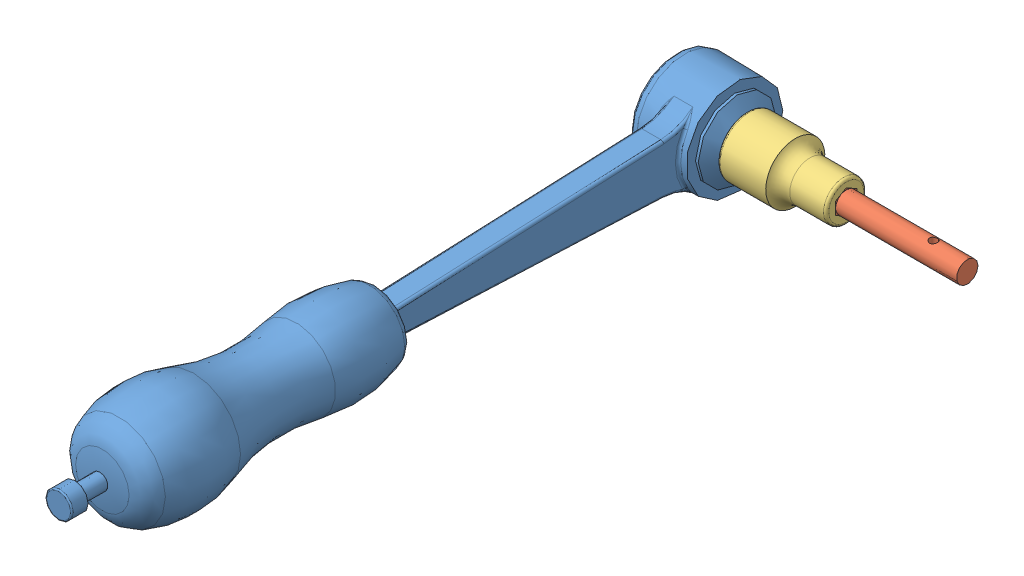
SolidWorks assembly ens axe clé.SLDASM, configuration Défaut (file format 4400). Lengths in mm.
Overall size (118.84 39.68 267.72).
5 component instances, 4 part files, 5 mates.
Components (placement in the parent):
- p24-1: p24.SLDPRT [Défaut] at (57.4717 -10.0864 66.06) x (0 1 0) z (-1 0 0) size (32.96 34.08 30)
- clé à cliquet-1: clé à cliquet.SLDPRT [Défaut] at (-22.0283 -10.2225 66.196) x (0 0 1) z (-1 0 0) size (267.72 39.68 46.84)
- axe moteur-1: axe moteur.SLDASM [Défaut] at (33.3076 -9.7282 66.06) size (82.59 22 22)
  - axe pignon-1: axe pignon.SLDPRT [Défaut] at (-17.3359 -0.3582 0) size (64 10.16 8)
  - douille-1: douille.SLDPRT [Défaut] at (-15.3359 -0.3582 0) x (1 0 0) z (0 -1 0) size (37.59 22 22)
Mates (geometry in assembly coordinates):
- Coaxial1: concentric aligned: cylinder of p24-1 through (46.9717 -10.0864 66.06) axis (1 0 0) radius 4; cylinder of axe moteur-1/axe pignon-1 through (15.9717 -10.0864 66.06) axis (1 0 0) radius 4
- Coïncidente1: coincident anti-aligned: plane of clé à cliquet-1 through (4.9717 -16.5864 72.56) normal (0 0 1); plane of axe moteur-1/douille-1 through (7.9717 -4.5864 72.56) normal (0 0 -1)
- Coïncidente2: coincident anti-aligned: plane of clé à cliquet-1 through (4.9717 -16.5864 59.8321) normal (0 -1 0); plane of axe moteur-1/douille-1 through (7.9717 -16.5864 71.56) normal (0 1 0)
- Coïncidente3: coincident anti-aligned: plane of clé à cliquet-1 through (-10.0283 -10.2225 57.196) normal (1 0 0); plane of axe moteur-1/douille-1 through (-10.0283 -10.0864 75.06) normal (-1 0 0)
- Coaxial2: concentric anti-aligned: cylinder of assembly through (59.4717 19.9136 66.06) axis (0 -1 0) radius 1.55; cylinder of assembly through (59.4717 -15.0864 66.06) axis (0 1 0) radius 1.5
